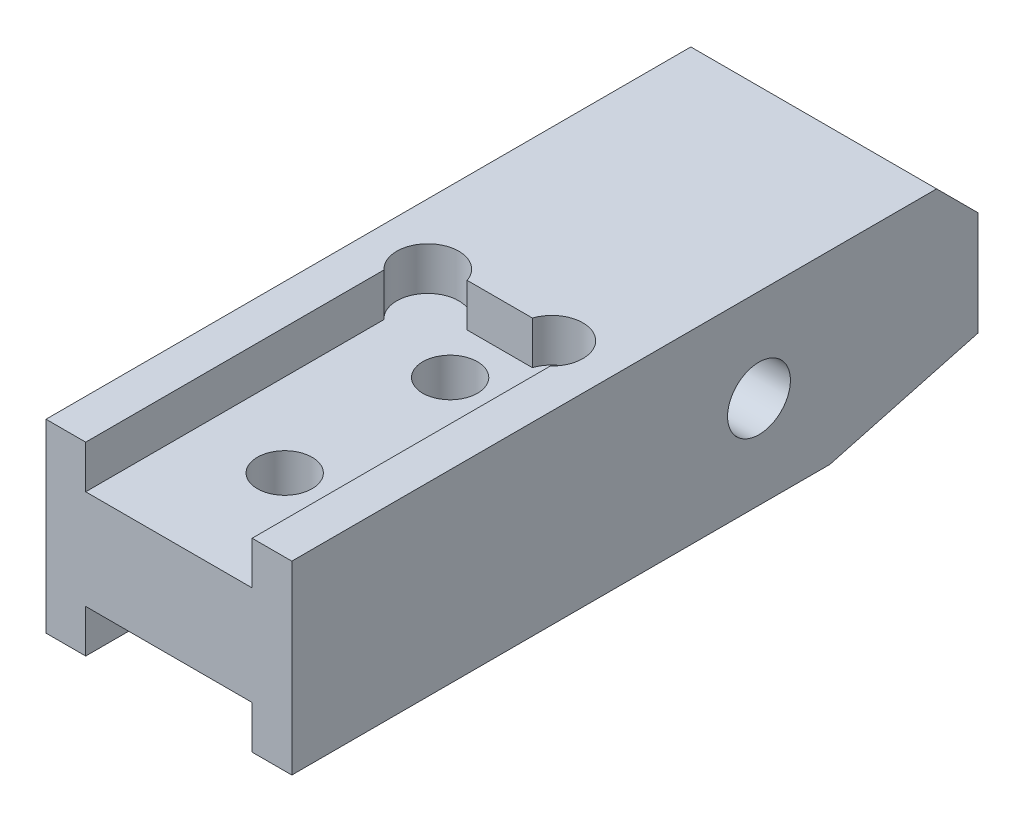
from build123d import *

# Parameters (mm, degrees)
SKETCH1_W            = 18.8722
SKETCH1_H            = 52.6796
EXTRUDE1_DEPTH       = 7.112
KEY_POCKET_DEPTH     = 3.302
M5_X_8_MOUNT_HOLES_D = 4.2
SKETCH6_R            = 2.413
CUT_EXTRUDE2_DEPTH   = 34.174169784
CUT_EXTRUDE3_DEPTH   = 34.174169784
CHAMFER1_SIZE        = 3.175


with BuildPart() as part:
    # Sketch1 → Extrude1 (new, symmetric)
    with BuildSketch(Plane(origin=(0, 0, 0), x_dir=(1, 0, 0), z_dir=(0, 1, 0))):
        Rectangle(SKETCH1_W, SKETCH1_H)
    extrude(amount=EXTRUDE1_DEPTH, both=True)

    # Sketch2 → Key Pocket (cut)
    with BuildSketch(Plane(origin=(0, 7.112, 0), x_dir=(-1, 0, 0), z_dir=(0, 1, 0))):
        with BuildLine():
            Line((-6.3881, 26.3398), (6.3881, 26.3398))
            Line((6.3881, 26.3398), (6.3881, 3.441850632))
            ThreePointArc((6.3881, 3.441850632), (6.05262688, -0.299680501), (2.506461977, 0.9398))
            Line((2.506461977, 0.9398), (-2.506461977, 0.9398))
            ThreePointArc((-2.506461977, 0.9398), (-6.05262688, -0.299680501), (-6.3881, 3.441850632))
            Line((-6.3881, 3.441850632), (-6.3881, 26.3398))
        make_face()
    key_pocket = extrude(amount=-KEY_POCKET_DEPTH, mode=Mode.SUBTRACT)

    # Mirror1: Key Pocket across plane
    add(key_pocket.mirror(Plane.ZX), mode=Mode.SUBTRACT)

    # M5 X .8 _Mount Holes (through all)
    with Locations(Plane(origin=(0, 3.81, 0), x_dir=(-1, 0, 0), z_dir=(0, 1, 0))):
        with Locations((0, 4.7498), (0, 17.4498)):
            Hole(M5_X_8_MOUNT_HOLES_D / 2)

    # Sketch6 → Cut-Extrude2 (cut, through all)
    with BuildSketch(Plane.ZY.offset(9.4361)):
        with Locations((-9.525, 0)):
            Circle(SKETCH6_R)
    extrude(amount=-CUT_EXTRUDE2_DEPTH, mode=Mode.SUBTRACT)

    # Sketch7 → Cut-Extrude3 (cut, through all)
    with BuildSketch(Plane.ZY.offset(9.4361)):
        Polygon((-14.964509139, -7.112), (-26.3398, -4.064), (-26.3398, -7.112), align=None)
    extrude(amount=-CUT_EXTRUDE3_DEPTH, mode=Mode.SUBTRACT)

    # Chamfer1
    chamfer1_edges = [part.edges().sort_by_distance(p)[0] for p in [
        (0, 7.112, -26.3398),
    ]]
    chamfer(chamfer1_edges, length=CHAMFER1_SIZE)


solid = part.part
